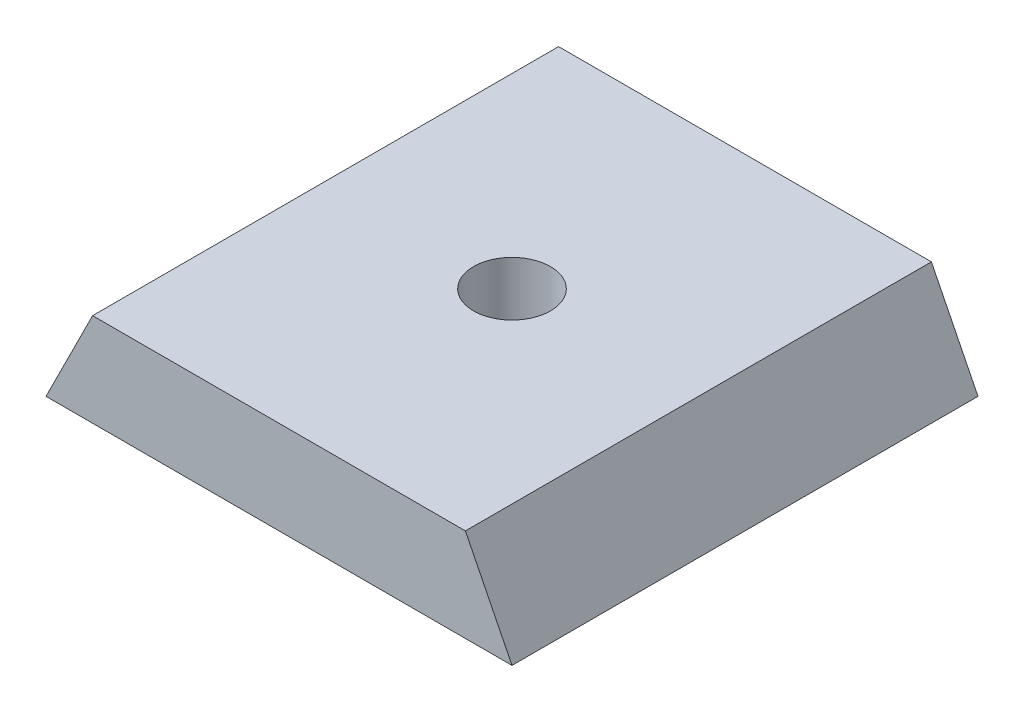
ISO-10303-21;
HEADER;
FILE_DESCRIPTION(('STEP AP214'),'2;1');
FILE_NAME('part.step','',(''),(''),'','','');
FILE_SCHEMA(('AUTOMOTIVE_DESIGN { 1 0 10303 214 1 1 1 1 }'));
ENDSEC;
DATA;
#1=APPLICATION_CONTEXT('core data for automotive mechanical design processes');
#2=APPLICATION_PROTOCOL_DEFINITION('international standard','automotive_design',2000,#1);
#3=PRODUCT_CONTEXT('',#1,'mechanical');
#4=PRODUCT('Part','Part','',(#3));
#5=PRODUCT_RELATED_PRODUCT_CATEGORY('part','',(#4));
#6=PRODUCT_DEFINITION_FORMATION('','',#4);
#7=PRODUCT_DEFINITION_CONTEXT('part definition',#1,'design');
#8=PRODUCT_DEFINITION('design','',#6,#7);
#9=PRODUCT_DEFINITION_SHAPE('','',#8);
#10=(LENGTH_UNIT() NAMED_UNIT(*) SI_UNIT(.MILLI.,.METRE.));
#11=(NAMED_UNIT(*) PLANE_ANGLE_UNIT() SI_UNIT($,.RADIAN.));
#12=(NAMED_UNIT(*) SI_UNIT($,.STERADIAN.) SOLID_ANGLE_UNIT());
#13=UNCERTAINTY_MEASURE_WITH_UNIT(LENGTH_MEASURE(1.E-05),#10,'distance_accuracy_value','');
#14=(GEOMETRIC_REPRESENTATION_CONTEXT(3) GLOBAL_UNCERTAINTY_ASSIGNED_CONTEXT((#13)) GLOBAL_UNIT_ASSIGNED_CONTEXT((#10,
#11,#12)) REPRESENTATION_CONTEXT('',''));
#15=CARTESIAN_POINT('',(0.,0.,0.));
#16=DIRECTION('',(0.,0.,1.));
#17=DIRECTION('',(1.,0.,0.));
#18=AXIS2_PLACEMENT_3D('',#15,#16,#17);
#19=CARTESIAN_POINT('',(0.,0.,-20.));
#20=DIRECTION('',(0.,-1.,0.));
#21=DIRECTION('',(0.,0.,-1.));
#22=AXIS2_PLACEMENT_3D('',#19,#20,#21);
#23=PLANE('',#22);
#24=DIRECTION('',(0.,0.,1.));
#25=VECTOR('',#24,1.);
#26=CARTESIAN_POINT('',(0.,0.,0.));
#27=LINE('',#26,#25);
#28=CARTESIAN_POINT('',(0.,0.,-20.));
#29=VERTEX_POINT('',#28);
#30=CARTESIAN_POINT('',(0.,0.,0.));
#31=VERTEX_POINT('',#30);
#32=EDGE_CURVE('E87',#29,#31,#27,.T.);
#33=ORIENTED_EDGE('',*,*,#32,.F.);
#34=DIRECTION('',(-1.,0.,0.));
#35=VECTOR('',#34,1.);
#36=CARTESIAN_POINT('',(0.,0.,-20.));
#37=LINE('',#36,#35);
#38=CARTESIAN_POINT('',(20.,0.,-20.));
#39=VERTEX_POINT('',#38);
#40=EDGE_CURVE('E102',#39,#29,#37,.T.);
#41=ORIENTED_EDGE('',*,*,#40,.F.);
#42=DIRECTION('',(0.,0.,-1.));
#43=VECTOR('',#42,1.);
#44=CARTESIAN_POINT('',(20.,0.,0.));
#45=LINE('',#44,#43);
#46=CARTESIAN_POINT('',(20.,0.,0.));
#47=VERTEX_POINT('',#46);
#48=EDGE_CURVE('E88',#47,#39,#45,.T.);
#49=ORIENTED_EDGE('',*,*,#48,.F.);
#50=DIRECTION('',(1.,0.,0.));
#51=VECTOR('',#50,1.);
#52=CARTESIAN_POINT('',(0.,0.,0.));
#53=LINE('',#52,#51);
#54=EDGE_CURVE('E73',#31,#47,#53,.T.);
#55=ORIENTED_EDGE('',*,*,#54,.F.);
#56=EDGE_LOOP('',(#33,#41,#49,#55));
#57=FACE_BOUND('',#56,.T.);
#58=CARTESIAN_POINT('',(10.,0.,-10.));
#59=DIRECTION('',(0.,1.,0.));
#60=DIRECTION('',(0.,0.,1.));
#61=AXIS2_PLACEMENT_3D('',#58,#59,#60);
#62=CIRCLE('',#61,1.65);
#63=CARTESIAN_POINT('',(10.,0.,-8.35));
#64=VERTEX_POINT('',#63);
#65=EDGE_CURVE('E92',#64,#64,#62,.T.);
#66=ORIENTED_EDGE('',*,*,#65,.T.);
#67=EDGE_LOOP('',(#66));
#68=FACE_BOUND('',#67,.T.);
#69=ADVANCED_FACE('F31',(#57,#68),#23,.T.);
#70=CARTESIAN_POINT('',(0.,4.,0.));
#71=DIRECTION('',(0.,0.,-1.));
#72=DIRECTION('',(-1.,0.,0.));
#73=AXIS2_PLACEMENT_3D('',#70,#71,#72);
#74=PLANE('',#73);
#75=DIRECTION('',(1.,0.,0.));
#76=VECTOR('',#75,1.);
#77=CARTESIAN_POINT('',(0.,4.,0.));
#78=LINE('',#77,#76);
#79=CARTESIAN_POINT('',(2.,4.,0.));
#80=VERTEX_POINT('',#79);
#81=CARTESIAN_POINT('',(18.,4.,0.));
#82=VERTEX_POINT('',#81);
#83=EDGE_CURVE('E76',#80,#82,#78,.T.);
#84=ORIENTED_EDGE('',*,*,#83,.F.);
#85=DIRECTION('',(0.447213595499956,0.894427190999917,0.));
#86=VECTOR('',#85,1.);
#87=CARTESIAN_POINT('',(2.,4.,0.));
#88=LINE('',#87,#86);
#89=EDGE_CURVE('E70',#80,#31,#88,.F.);
#90=ORIENTED_EDGE('',*,*,#89,.T.);
#91=ORIENTED_EDGE('',*,*,#54,.T.);
#92=DIRECTION('',(0.447213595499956,-0.894427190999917,0.));
#93=VECTOR('',#92,1.);
#94=CARTESIAN_POINT('',(18.,4.,0.));
#95=LINE('',#94,#93);
#96=EDGE_CURVE('E81',#47,#82,#95,.F.);
#97=ORIENTED_EDGE('',*,*,#96,.T.);
#98=EDGE_LOOP('',(#84,#90,#91,#97));
#99=FACE_BOUND('',#98,.T.);
#100=ADVANCED_FACE('F72',(#99),#74,.F.);
#101=CARTESIAN_POINT('',(0.,4.,-20.));
#102=DIRECTION('',(0.,0.,1.));
#103=DIRECTION('',(1.,0.,0.));
#104=AXIS2_PLACEMENT_3D('',#101,#102,#103);
#105=PLANE('',#104);
#106=ORIENTED_EDGE('',*,*,#40,.T.);
#107=DIRECTION('',(-0.447213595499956,-0.894427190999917,0.));
#108=VECTOR('',#107,1.);
#109=CARTESIAN_POINT('',(2.,4.,-20.));
#110=LINE('',#109,#108);
#111=CARTESIAN_POINT('',(2.,4.,-20.));
#112=VERTEX_POINT('',#111);
#113=EDGE_CURVE('E11',#29,#112,#110,.F.);
#114=ORIENTED_EDGE('',*,*,#113,.T.);
#115=DIRECTION('',(-1.,0.,0.));
#116=VECTOR('',#115,1.);
#117=CARTESIAN_POINT('',(0.,4.,-20.));
#118=LINE('',#117,#116);
#119=CARTESIAN_POINT('',(18.,4.,-20.));
#120=VERTEX_POINT('',#119);
#121=EDGE_CURVE('E98',#120,#112,#118,.T.);
#122=ORIENTED_EDGE('',*,*,#121,.F.);
#123=DIRECTION('',(-0.447213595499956,0.894427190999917,0.));
#124=VECTOR('',#123,1.);
#125=CARTESIAN_POINT('',(18.,4.,-20.));
#126=LINE('',#125,#124);
#127=EDGE_CURVE('E39',#120,#39,#126,.F.);
#128=ORIENTED_EDGE('',*,*,#127,.T.);
#129=EDGE_LOOP('',(#106,#114,#122,#128));
#130=FACE_BOUND('',#129,.T.);
#131=ADVANCED_FACE('F108',(#130),#105,.F.);
#132=CARTESIAN_POINT('',(0.,4.,-20.));
#133=DIRECTION('',(0.,-1.,0.));
#134=DIRECTION('',(0.,0.,-1.));
#135=AXIS2_PLACEMENT_3D('',#132,#133,#134);
#136=PLANE('',#135);
#137=CARTESIAN_POINT('',(10.,4.,-10.));
#138=DIRECTION('',(0.,1.,0.));
#139=DIRECTION('',(0.,0.,1.));
#140=AXIS2_PLACEMENT_3D('',#137,#138,#139);
#141=CIRCLE('',#140,1.64999999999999);
#142=CARTESIAN_POINT('',(10.,4.,-8.35000000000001));
#143=VERTEX_POINT('',#142);
#144=EDGE_CURVE('E95',#143,#143,#141,.T.);
#145=ORIENTED_EDGE('',*,*,#144,.F.);
#146=EDGE_LOOP('',(#145));
#147=FACE_BOUND('',#146,.T.);
#148=ORIENTED_EDGE('',*,*,#121,.T.);
#149=DIRECTION('',(0.,0.,1.));
#150=VECTOR('',#149,1.);
#151=CARTESIAN_POINT('',(2.,4.,-20.));
#152=LINE('',#151,#150);
#153=EDGE_CURVE('E106',#112,#80,#152,.T.);
#154=ORIENTED_EDGE('',*,*,#153,.T.);
#155=ORIENTED_EDGE('',*,*,#83,.T.);
#156=DIRECTION('',(0.,0.,-1.));
#157=VECTOR('',#156,1.);
#158=CARTESIAN_POINT('',(18.,4.,-20.));
#159=LINE('',#158,#157);
#160=EDGE_CURVE('E104',#82,#120,#159,.T.);
#161=ORIENTED_EDGE('',*,*,#160,.T.);
#162=EDGE_LOOP('',(#148,#154,#155,#161));
#163=FACE_BOUND('',#162,.T.);
#164=ADVANCED_FACE('F110',(#147,#163),#136,.F.);
#165=CARTESIAN_POINT('',(2.,4.,-20.));
#166=DIRECTION('',(0.894427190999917,-0.447213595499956,0.));
#167=DIRECTION('',(0.447213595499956,0.894427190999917,0.));
#168=AXIS2_PLACEMENT_3D('',#165,#166,#167);
#169=PLANE('',#168);
#170=ORIENTED_EDGE('',*,*,#113,.F.);
#171=ORIENTED_EDGE('',*,*,#32,.T.);
#172=ORIENTED_EDGE('',*,*,#89,.F.);
#173=ORIENTED_EDGE('',*,*,#153,.F.);
#174=EDGE_LOOP('',(#170,#171,#172,#173));
#175=FACE_BOUND('',#174,.T.);
#176=ADVANCED_FACE('F91',(#175),#169,.F.);
#177=CARTESIAN_POINT('',(18.,4.,-20.));
#178=DIRECTION('',(-0.894427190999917,-0.447213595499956,0.));
#179=DIRECTION('',(0.447213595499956,-0.894427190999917,0.));
#180=AXIS2_PLACEMENT_3D('',#177,#178,#179);
#181=PLANE('',#180);
#182=ORIENTED_EDGE('',*,*,#96,.F.);
#183=ORIENTED_EDGE('',*,*,#48,.T.);
#184=ORIENTED_EDGE('',*,*,#127,.F.);
#185=ORIENTED_EDGE('',*,*,#160,.F.);
#186=EDGE_LOOP('',(#182,#183,#184,#185));
#187=FACE_BOUND('',#186,.T.);
#188=ADVANCED_FACE('F33',(#187),#181,.F.);
#189=CARTESIAN_POINT('',(10.,4.,-10.));
#190=DIRECTION('',(0.,1.,0.));
#191=DIRECTION('',(0.,0.,1.));
#192=AXIS2_PLACEMENT_3D('',#189,#190,#191);
#193=CYLINDRICAL_SURFACE('',#192,1.64999999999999);
#194=ORIENTED_EDGE('',*,*,#65,.F.);
#195=EDGE_LOOP('',(#194));
#196=FACE_BOUND('',#195,.T.);
#197=ORIENTED_EDGE('',*,*,#144,.T.);
#198=EDGE_LOOP('',(#197));
#199=FACE_BOUND('',#198,.T.);
#200=ADVANCED_FACE('F115',(#196,#199),#193,.F.);
#201=CLOSED_SHELL('',(#69,#100,#131,#164,#176,#188,#200));
#202=MANIFOLD_SOLID_BREP('B2',#201);
#203=ADVANCED_BREP_SHAPE_REPRESENTATION('',(#18,#202),#14);
#204=SHAPE_DEFINITION_REPRESENTATION(#9,#203);
ENDSEC;
END-ISO-10303-21;
